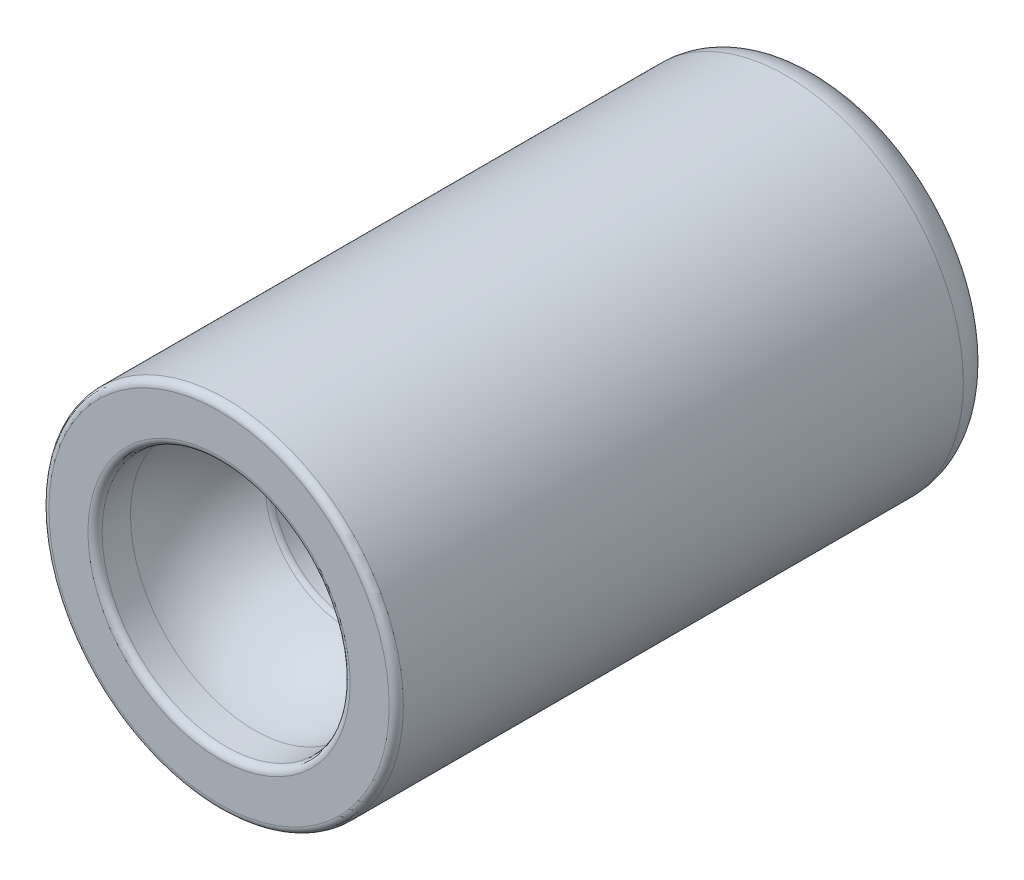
from build123d import *

# Parameters (mm, degrees)
CONG_1_R = 0.2


with BuildPart() as part:
    # Esquisse1 → R_volution1 (revolve)
    with BuildSketch(Plane(origin=(0, 0, 0), x_dir=(0, 0, -1), z_dir=(1, 0, 0)), mode=Mode.PRIVATE) as r_volution1_sk:
        with BuildLine():
            Line((0, 5), (16, 5))
            ThreePointArc((16, 5), (16.707106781, 4.707106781), (17, 4))
            Line((17, 4), (17, 3.5))
            Line((17, 3.5), (12.5, 3.5))
            ThreePointArc((12.5, 3.5), (11.020980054, 3.172144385), (9.819048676, 2.25))
            Line((9.819048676, 2.25), (3.680951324, 2.25))
            ThreePointArc((3.680951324, 2.25), (2.479019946, 3.172144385), (1, 3.5))
            Line((1, 3.5), (0, 3.5))
            Line((0, 3.5), (0, 5))
        make_face()
    revolve(r_volution1_sk.sketch.rotate(Axis((0, 0, 0), (0, 0, -1)), 90), axis=Axis((0, 0, 0), (0, 0, -1)))

    # Cong_1
    cong_1_edges = [part.edges().sort_by_distance(p)[0] for p in [
        (-5, 0, 0),
        (-3.5, 0, -17),
        (-2.25, 0, -9.819048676),
        (-2.25, 0, -3.680951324),
        (-3.5, 0, 0),
    ]]
    fillet(cong_1_edges, radius=CONG_1_R)


solid = part.part
